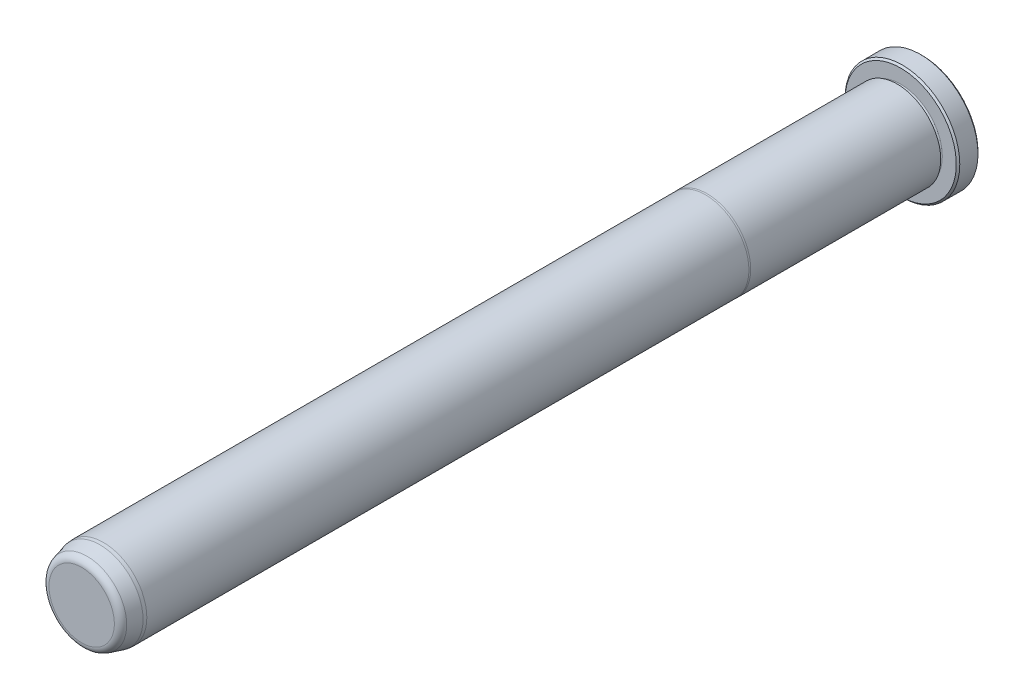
ISO-10303-21;
HEADER;
FILE_DESCRIPTION(('STEP AP214'),'2;1');
FILE_NAME('part.step','',(''),(''),'','','');
FILE_SCHEMA(('AUTOMOTIVE_DESIGN { 1 0 10303 214 1 1 1 1 }'));
ENDSEC;
DATA;
#1=APPLICATION_CONTEXT('core data for automotive mechanical design processes');
#2=APPLICATION_PROTOCOL_DEFINITION('international standard','automotive_design',2000,#1);
#3=PRODUCT_CONTEXT('',#1,'mechanical');
#4=PRODUCT('Part','Part','',(#3));
#5=PRODUCT_RELATED_PRODUCT_CATEGORY('part','',(#4));
#6=PRODUCT_DEFINITION_FORMATION('','',#4);
#7=PRODUCT_DEFINITION_CONTEXT('part definition',#1,'design');
#8=PRODUCT_DEFINITION('design','',#6,#7);
#9=PRODUCT_DEFINITION_SHAPE('','',#8);
#10=(LENGTH_UNIT() NAMED_UNIT(*) SI_UNIT(.MILLI.,.METRE.));
#11=(NAMED_UNIT(*) PLANE_ANGLE_UNIT() SI_UNIT($,.RADIAN.));
#12=(NAMED_UNIT(*) SI_UNIT($,.STERADIAN.) SOLID_ANGLE_UNIT());
#13=UNCERTAINTY_MEASURE_WITH_UNIT(LENGTH_MEASURE(1.E-05),#10,'distance_accuracy_value','');
#14=(GEOMETRIC_REPRESENTATION_CONTEXT(3) GLOBAL_UNCERTAINTY_ASSIGNED_CONTEXT((#13)) GLOBAL_UNIT_ASSIGNED_CONTEXT((#10,
#11,#12)) REPRESENTATION_CONTEXT('',''));
#15=CARTESIAN_POINT('',(0.,0.,0.));
#16=DIRECTION('',(0.,0.,1.));
#17=DIRECTION('',(1.,0.,0.));
#18=AXIS2_PLACEMENT_3D('',#15,#16,#17);
#19=CARTESIAN_POINT('',(0.,0.,0.));
#20=DIRECTION('',(0.,0.,1.));
#21=DIRECTION('',(1.,0.,0.));
#22=AXIS2_PLACEMENT_3D('',#19,#20,#21);
#23=PLANE('',#22);
#24=CARTESIAN_POINT('',(0.,0.,0.));
#25=DIRECTION('',(0.,0.,1.));
#26=DIRECTION('',(1.,0.,0.));
#27=AXIS2_PLACEMENT_3D('',#24,#25,#26);
#28=CIRCLE('',#27,12.192);
#29=CARTESIAN_POINT('',(12.192,0.,0.));
#30=VERTEX_POINT('',#29);
#31=EDGE_CURVE('E37',#30,#30,#28,.F.);
#32=ORIENTED_EDGE('',*,*,#31,.T.);
#33=EDGE_LOOP('',(#32));
#34=FACE_BOUND('',#33,.T.);
#35=ADVANCED_FACE('F30',(#34),#23,.F.);
#36=CARTESIAN_POINT('',(0.,0.,0.));
#37=DIRECTION('',(0.,0.,1.));
#38=DIRECTION('',(1.,0.,0.));
#39=AXIS2_PLACEMENT_3D('',#36,#37,#38);
#40=CYLINDRICAL_SURFACE('',#39,12.573);
#41=CARTESIAN_POINT('',(0.,0.,0.380999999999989));
#42=DIRECTION('',(0.,0.,1.));
#43=DIRECTION('',(1.,0.,0.));
#44=AXIS2_PLACEMENT_3D('',#41,#42,#43);
#45=CIRCLE('',#44,12.573);
#46=CARTESIAN_POINT('',(12.573,0.,0.380999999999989));
#47=VERTEX_POINT('',#46);
#48=EDGE_CURVE('E41',#47,#47,#45,.T.);
#49=ORIENTED_EDGE('',*,*,#48,.T.);
#50=EDGE_LOOP('',(#49));
#51=FACE_BOUND('',#50,.T.);
#52=CARTESIAN_POINT('',(0.,0.,4.36880000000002));
#53=DIRECTION('',(0.,0.,-1.));
#54=DIRECTION('',(-1.,0.,0.));
#55=AXIS2_PLACEMENT_3D('',#52,#53,#54);
#56=CIRCLE('',#55,12.573);
#57=CARTESIAN_POINT('',(-12.573,0.,4.36880000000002));
#58=VERTEX_POINT('',#57);
#59=EDGE_CURVE('E45',#58,#58,#56,.T.);
#60=ORIENTED_EDGE('',*,*,#59,.T.);
#61=EDGE_LOOP('',(#60));
#62=FACE_BOUND('',#61,.T.);
#63=ADVANCED_FACE('F118',(#51,#62),#40,.T.);
#64=CARTESIAN_POINT('',(0.,12.573,4.7498));
#65=DIRECTION('',(0.,0.,-1.));
#66=DIRECTION('',(-1.,0.,0.));
#67=AXIS2_PLACEMENT_3D('',#64,#65,#66);
#68=PLANE('',#67);
#69=CARTESIAN_POINT('',(0.,0.,4.7498));
#70=DIRECTION('',(0.,0.,-1.));
#71=DIRECTION('',(-1.,0.,0.));
#72=AXIS2_PLACEMENT_3D('',#69,#70,#71);
#73=CIRCLE('',#72,12.192);
#74=CARTESIAN_POINT('',(-12.192,0.,4.7498));
#75=VERTEX_POINT('',#74);
#76=EDGE_CURVE('E10',#75,#75,#73,.F.);
#77=ORIENTED_EDGE('',*,*,#76,.T.);
#78=EDGE_LOOP('',(#77));
#79=FACE_BOUND('',#78,.T.);
#80=CARTESIAN_POINT('',(0.,0.,4.7498));
#81=DIRECTION('',(0.,0.,1.));
#82=DIRECTION('',(1.,0.,0.));
#83=AXIS2_PLACEMENT_3D('',#80,#81,#82);
#84=CIRCLE('',#83,9.1313);
#85=CARTESIAN_POINT('',(9.1313,0.,4.7498));
#86=VERTEX_POINT('',#85);
#87=EDGE_CURVE('E56',#86,#86,#84,.T.);
#88=ORIENTED_EDGE('',*,*,#87,.F.);
#89=EDGE_LOOP('',(#88));
#90=FACE_BOUND('',#89,.T.);
#91=ADVANCED_FACE('F113',(#79,#90),#68,.F.);
#92=CARTESIAN_POINT('',(0.,0.,5.1308));
#93=DIRECTION('',(0.,0.,1.));
#94=DIRECTION('',(1.,0.,0.));
#95=AXIS2_PLACEMENT_3D('',#92,#93,#94);
#96=TOROIDAL_SURFACE('',#95,9.1313,0.381);
#97=CARTESIAN_POINT('',(0.,0.,5.5118));
#98=DIRECTION('',(0.,0.,1.));
#99=DIRECTION('',(1.,0.,0.));
#100=AXIS2_PLACEMENT_3D('',#97,#98,#99);
#101=CIRCLE('',#100,9.1313);
#102=CARTESIAN_POINT('',(9.1313,0.,5.5118));
#103=VERTEX_POINT('',#102);
#104=EDGE_CURVE('E59',#103,#103,#101,.T.);
#105=ORIENTED_EDGE('',*,*,#104,.F.);
#106=EDGE_LOOP('',(#105));
#107=FACE_BOUND('',#106,.T.);
#108=ORIENTED_EDGE('',*,*,#87,.T.);
#109=EDGE_LOOP('',(#108));
#110=FACE_BOUND('',#109,.T.);
#111=ADVANCED_FACE('F107',(#107,#110),#96,.F.);
#112=CARTESIAN_POINT('',(0.,9.1313,5.5118));
#113=DIRECTION('',(0.,0.,1.));
#114=DIRECTION('',(1.,0.,0.));
#115=AXIS2_PLACEMENT_3D('',#112,#113,#114);
#116=PLANE('',#115);
#117=CARTESIAN_POINT('',(0.,0.,5.5118));
#118=DIRECTION('',(0.,0.,1.));
#119=DIRECTION('',(1.,0.,0.));
#120=AXIS2_PLACEMENT_3D('',#117,#118,#119);
#121=CIRCLE('',#120,9.5377);
#122=CARTESIAN_POINT('',(9.5377,0.,5.5118));
#123=VERTEX_POINT('',#122);
#124=EDGE_CURVE('E62',#123,#123,#121,.T.);
#125=ORIENTED_EDGE('',*,*,#124,.F.);
#126=EDGE_LOOP('',(#125));
#127=FACE_BOUND('',#126,.T.);
#128=ORIENTED_EDGE('',*,*,#104,.T.);
#129=EDGE_LOOP('',(#128));
#130=FACE_BOUND('',#129,.T.);
#131=ADVANCED_FACE('F101',(#127,#130),#116,.F.);
#132=CARTESIAN_POINT('',(0.,0.,0.));
#133=DIRECTION('',(0.,0.,1.));
#134=DIRECTION('',(1.,0.,0.));
#135=AXIS2_PLACEMENT_3D('',#132,#133,#134);
#136=CYLINDRICAL_SURFACE('',#135,9.5377);
#137=CARTESIAN_POINT('',(0.,0.,47.1347630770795));
#138=DIRECTION('',(0.,0.,1.));
#139=DIRECTION('',(1.,0.,0.));
#140=AXIS2_PLACEMENT_3D('',#137,#138,#139);
#141=CIRCLE('',#140,9.53769999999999);
#142=CARTESIAN_POINT('',(9.53769999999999,0.,47.1347630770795));
#143=VERTEX_POINT('',#142);
#144=EDGE_CURVE('E65',#143,#143,#141,.T.);
#145=ORIENTED_EDGE('',*,*,#144,.F.);
#146=EDGE_LOOP('',(#145));
#147=FACE_BOUND('',#146,.T.);
#148=ORIENTED_EDGE('',*,*,#124,.T.);
#149=EDGE_LOOP('',(#148));
#150=FACE_BOUND('',#149,.T.);
#151=ADVANCED_FACE('F95',(#147,#150),#136,.T.);
#152=CARTESIAN_POINT('',(0.,0.,47.1347630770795));
#153=DIRECTION('',(0.,0.,-1.));
#154=DIRECTION('',(-1.,0.,0.));
#155=AXIS2_PLACEMENT_3D('',#152,#153,#154);
#156=CONICAL_SURFACE('',#155,9.53769999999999,0.0698131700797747);
#157=CARTESIAN_POINT('',(0.,0.,47.498));
#158=DIRECTION('',(0.,0.,1.));
#159=DIRECTION('',(1.,0.,0.));
#160=AXIS2_PLACEMENT_3D('',#157,#158,#159);
#161=CIRCLE('',#160,9.5123);
#162=CARTESIAN_POINT('',(9.5123,0.,47.498));
#163=VERTEX_POINT('',#162);
#164=EDGE_CURVE('E68',#163,#163,#161,.T.);
#165=ORIENTED_EDGE('',*,*,#164,.F.);
#166=EDGE_LOOP('',(#165));
#167=FACE_BOUND('',#166,.T.);
#168=ORIENTED_EDGE('',*,*,#144,.T.);
#169=EDGE_LOOP('',(#168));
#170=FACE_BOUND('',#169,.T.);
#171=ADVANCED_FACE('F89',(#167,#170),#156,.T.);
#172=CARTESIAN_POINT('',(0.,0.,0.));
#173=DIRECTION('',(0.,0.,1.));
#174=DIRECTION('',(1.,0.,0.));
#175=AXIS2_PLACEMENT_3D('',#172,#173,#174);
#176=CYLINDRICAL_SURFACE('',#175,9.51229999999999);
#177=CARTESIAN_POINT('',(0.,0.,179.3875));
#178=DIRECTION('',(0.,0.,1.));
#179=DIRECTION('',(1.,0.,0.));
#180=AXIS2_PLACEMENT_3D('',#177,#178,#179);
#181=CIRCLE('',#180,9.51229999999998);
#182=CARTESIAN_POINT('',(9.51229999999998,0.,179.3875));
#183=VERTEX_POINT('',#182);
#184=EDGE_CURVE('E71',#183,#183,#181,.T.);
#185=ORIENTED_EDGE('',*,*,#184,.F.);
#186=EDGE_LOOP('',(#185));
#187=FACE_BOUND('',#186,.T.);
#188=ORIENTED_EDGE('',*,*,#164,.T.);
#189=EDGE_LOOP('',(#188));
#190=FACE_BOUND('',#189,.T.);
#191=ADVANCED_FACE('F83',(#187,#190),#176,.T.);
#192=CARTESIAN_POINT('',(0.,0.,179.3875));
#193=DIRECTION('',(0.,0.,-1.));
#194=DIRECTION('',(-1.,0.,0.));
#195=AXIS2_PLACEMENT_3D('',#192,#193,#194);
#196=CONICAL_SURFACE('',#195,9.51229999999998,0.0872664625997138);
#197=CARTESIAN_POINT('',(0.,0.,180.1495));
#198=DIRECTION('',(0.,0.,1.));
#199=DIRECTION('',(1.,0.,0.));
#200=AXIS2_PLACEMENT_3D('',#197,#198,#199);
#201=CIRCLE('',#200,9.44563363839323);
#202=CARTESIAN_POINT('',(9.44563363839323,0.,180.1495));
#203=VERTEX_POINT('',#202);
#204=EDGE_CURVE('E74',#203,#203,#201,.T.);
#205=ORIENTED_EDGE('',*,*,#204,.F.);
#206=EDGE_LOOP('',(#205));
#207=FACE_BOUND('',#206,.T.);
#208=ORIENTED_EDGE('',*,*,#184,.T.);
#209=EDGE_LOOP('',(#208));
#210=FACE_BOUND('',#209,.T.);
#211=ADVANCED_FACE('F80',(#207,#210),#196,.T.);
#212=CARTESIAN_POINT('',(0.,0.,180.1495));
#213=DIRECTION('',(0.,0.,-1.));
#214=DIRECTION('',(-1.,0.,0.));
#215=AXIS2_PLACEMENT_3D('',#212,#213,#214);
#216=CONICAL_SURFACE('',#215,9.44563363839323,0.261799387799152);
#217=CARTESIAN_POINT('',(0.,0.,182.9733752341));
#218=DIRECTION('',(0.,0.,1.));
#219=DIRECTION('',(1.,0.,0.));
#220=AXIS2_PLACEMENT_3D('',#217,#218,#219);
#221=CIRCLE('',#220,8.68897854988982);
#222=CARTESIAN_POINT('',(8.68897854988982,0.,182.9733752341));
#223=VERTEX_POINT('',#222);
#224=EDGE_CURVE('E50',#223,#223,#221,.F.);
#225=ORIENTED_EDGE('',*,*,#224,.T.);
#226=EDGE_LOOP('',(#225));
#227=FACE_BOUND('',#226,.T.);
#228=ORIENTED_EDGE('',*,*,#204,.T.);
#229=EDGE_LOOP('',(#228));
#230=FACE_BOUND('',#229,.T.);
#231=ADVANCED_FACE('F78',(#227,#230),#216,.T.);
#232=CARTESIAN_POINT('',(0.,8.37370289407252,184.15));
#233=DIRECTION('',(0.,0.,-1.));
#234=DIRECTION('',(-1.,0.,0.));
#235=AXIS2_PLACEMENT_3D('',#232,#233,#234);
#236=PLANE('',#235);
#237=CARTESIAN_POINT('',(0.,0.,184.15));
#238=DIRECTION('',(0.,0.,-1.));
#239=DIRECTION('',(-1.,0.,0.));
#240=AXIS2_PLACEMENT_3D('',#237,#238,#239);
#241=CIRCLE('',#240,7.15557130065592);
#242=CARTESIAN_POINT('',(-7.15557130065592,0.,184.15));
#243=VERTEX_POINT('',#242);
#244=EDGE_CURVE('E53',#243,#243,#241,.F.);
#245=ORIENTED_EDGE('',*,*,#244,.T.);
#246=EDGE_LOOP('',(#245));
#247=FACE_BOUND('',#246,.T.);
#248=ADVANCED_FACE('F133',(#247),#236,.F.);
#249=CARTESIAN_POINT('',(0.,0.,182.5625));
#250=DIRECTION('',(0.,0.,-1.));
#251=DIRECTION('',(-1.,0.,0.));
#252=AXIS2_PLACEMENT_3D('',#249,#250,#251);
#253=TOROIDAL_SURFACE('',#252,7.15557130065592,1.5875);
#254=ORIENTED_EDGE('',*,*,#224,.F.);
#255=EDGE_LOOP('',(#254));
#256=FACE_BOUND('',#255,.T.);
#257=ORIENTED_EDGE('',*,*,#244,.F.);
#258=EDGE_LOOP('',(#257));
#259=FACE_BOUND('',#258,.T.);
#260=ADVANCED_FACE('F130',(#256,#259),#253,.T.);
#261=CARTESIAN_POINT('',(0.,0.,0.380999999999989));
#262=DIRECTION('',(0.,0.,1.));
#263=DIRECTION('',(1.,0.,0.));
#264=AXIS2_PLACEMENT_3D('',#261,#262,#263);
#265=CONICAL_SURFACE('',#264,12.573,0.785398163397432);
#266=ORIENTED_EDGE('',*,*,#31,.F.);
#267=EDGE_LOOP('',(#266));
#268=FACE_BOUND('',#267,.T.);
#269=ORIENTED_EDGE('',*,*,#48,.F.);
#270=EDGE_LOOP('',(#269));
#271=FACE_BOUND('',#270,.T.);
#272=ADVANCED_FACE('F132',(#268,#271),#265,.T.);
#273=CARTESIAN_POINT('',(0.,0.,4.7498));
#274=DIRECTION('',(0.,0.,-1.));
#275=DIRECTION('',(-1.,0.,0.));
#276=AXIS2_PLACEMENT_3D('',#273,#274,#275);
#277=CONICAL_SURFACE('',#276,12.192,0.785398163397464);
#278=ORIENTED_EDGE('',*,*,#59,.F.);
#279=EDGE_LOOP('',(#278));
#280=FACE_BOUND('',#279,.T.);
#281=ORIENTED_EDGE('',*,*,#76,.F.);
#282=EDGE_LOOP('',(#281));
#283=FACE_BOUND('',#282,.T.);
#284=ADVANCED_FACE('F32',(#280,#283),#277,.T.);
#285=CLOSED_SHELL('',(#35,#63,#91,#111,#131,#151,#171,#191,#211,#231,#248,#260,#272,#284));
#286=MANIFOLD_SOLID_BREP('B2',#285);
#287=ADVANCED_BREP_SHAPE_REPRESENTATION('',(#18,#286),#14);
#288=SHAPE_DEFINITION_REPRESENTATION(#9,#287);
ENDSEC;
END-ISO-10303-21;
